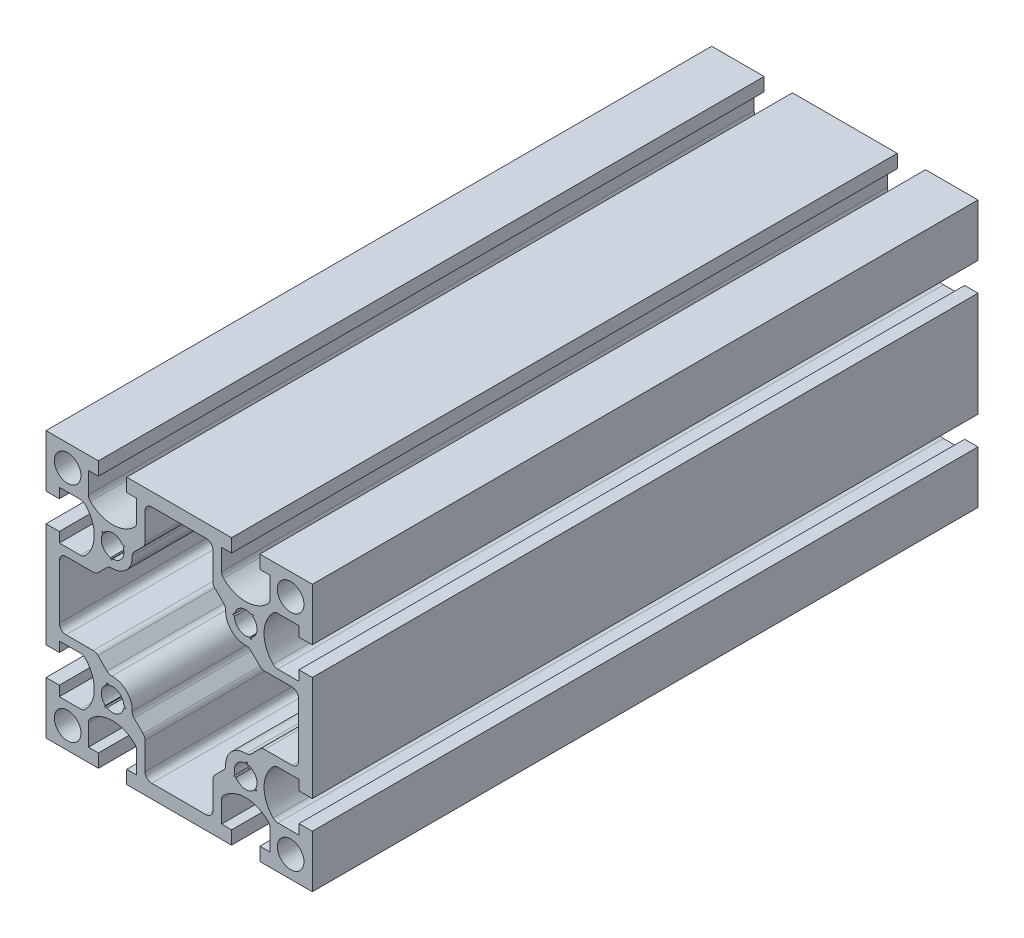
from build123d import *

# Parameters (mm, degrees)
SKETCH_1_W          = 80
SKETCH_1_H          = 80
EXTRUDE_1_DEPTH     = 100
SKETCH_2_R          = 4
SKETCH_2_R_2        = 3.4
CUT_EXTRUDE_1_DEPTH = 208.846096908
CUT_EXTRUDE_2_DEPTH = 208.846096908
CUT_EXTRUDE_3_DEPTH = 208.846096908
CUT_EXTRUDE_4_DEPTH = 208.846096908


with BuildPart() as part:
    # Sketch 1 → Extrude 1 (new, symmetric)
    with BuildSketch(Plane.XY):
        Rectangle(SKETCH_1_W, SKETCH_1_H)
    extrude(amount=EXTRUDE_1_DEPTH, both=True)

    # Sketch 2 → Cut-Extrude 1 (cut, through all)
    with BuildSketch(Plane.XY.offset(100)):
        with Locations((-33.5, -33.5)):
            Circle(SKETCH_2_R)
        with Locations((-20, -20)):
            Circle(SKETCH_2_R_2)
        with Locations(Location((33.5, -33.5, 0), (0, 0, 180))):
            Circle(SKETCH_2_R)
        with Locations(Location((20, -20, 0), (0, 0, 180))):
            Circle(SKETCH_2_R_2)
        with Locations((33.5, 33.5)):
            Circle(SKETCH_2_R)
        with Locations((20, 20)):
            Circle(SKETCH_2_R_2)
        with Locations(Location((-20, 20, 0), (0, 0, 180))):
            Circle(SKETCH_2_R_2)
        with Locations(Location((-33.5, 33.5, 0), (0, 0, 180))):
            Circle(SKETCH_2_R)
    extrude(amount=-CUT_EXTRUDE_1_DEPTH, mode=Mode.SUBTRACT)

    # Sketch 3 → Cut-Extrude 2 (cut, through all)
    with BuildSketch(Plane.XY.offset(100)):
        with BuildLine():
            Line((-40, -15.75), (-40, -24.25))
            Line((-40, -24.25), (-36, -24.25))
            Line((-36, -24.25), (-36, -27.25))
            Line((-36, -27.25), (-29.643928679, -27.25))
            ThreePointArc((-29.643928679, -27.25), (-28.869332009, -27.093908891), (-28.215642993, -26.65))
            ThreePointArc((-28.215642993, -26.65), (-25.5, -20), (-28.215642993, -13.35))
            ThreePointArc((-28.215642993, -13.35), (-28.869332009, -12.906091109), (-29.643928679, -12.75))
            Line((-29.643928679, -12.75), (-36, -12.75))
            Line((-36, -12.75), (-36, -15.75))
            Line((-36, -15.75), (-40, -15.75))
        make_face()
        with BuildLine():
            Line((-12.75, -36), (-12.75, -29.643928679))
            ThreePointArc((-12.75, -29.643928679), (-12.906091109, -28.869332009), (-13.35, -28.215642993))
            ThreePointArc((-13.35, -28.215642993), (-20, -25.5), (-26.65, -28.215642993))
            ThreePointArc((-26.65, -28.215642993), (-27.093908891, -28.869332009), (-27.25, -29.643928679))
            Line((-27.25, -29.643928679), (-27.25, -36))
            Line((-27.25, -36), (-24.25, -36))
            Line((-24.25, -36), (-24.25, -40))
            Line((-24.25, -40), (-15.75, -40))
            Line((-15.75, -40), (-15.75, -36))
            Line((-15.75, -36), (-12.75, -36))
        make_face()
        with BuildLine():
            Line((-15.75, 40), (-24.25, 40))
            Line((-24.25, 40), (-24.25, 36))
            Line((-24.25, 36), (-27.25, 36))
            Line((-27.25, 36), (-27.25, 29.643928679))
            ThreePointArc((-27.25, 29.643928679), (-27.093908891, 28.869332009), (-26.65, 28.215642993))
            ThreePointArc((-26.65, 28.215642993), (-20, 25.5), (-13.35, 28.215642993))
            ThreePointArc((-13.35, 28.215642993), (-12.906091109, 28.869332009), (-12.75, 29.643928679))
            Line((-12.75, 29.643928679), (-12.75, 36))
            Line((-12.75, 36), (-15.75, 36))
            Line((-15.75, 36), (-15.75, 40))
        make_face()
        with BuildLine():
            Line((-36, 12.75), (-29.643928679, 12.75))
            ThreePointArc((-29.643928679, 12.75), (-28.869332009, 12.906091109), (-28.215642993, 13.35))
            ThreePointArc((-28.215642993, 13.35), (-25.5, 20), (-28.215642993, 26.65))
            ThreePointArc((-28.215642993, 26.65), (-28.869332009, 27.093908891), (-29.643928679, 27.25))
            Line((-29.643928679, 27.25), (-36, 27.25))
            Line((-36, 27.25), (-36, 24.25))
            Line((-36, 24.25), (-40, 24.25))
            Line((-40, 24.25), (-40, 15.75))
            Line((-40, 15.75), (-36, 15.75))
            Line((-36, 15.75), (-36, 12.75))
        make_face()
        with BuildLine():
            Line((40, 15.75), (40, 24.25))
            Line((40, 24.25), (36, 24.25))
            Line((36, 24.25), (36, 27.25))
            Line((36, 27.25), (29.643928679, 27.25))
            ThreePointArc((29.643928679, 27.25), (28.869332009, 27.093908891), (28.215642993, 26.65))
            ThreePointArc((28.215642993, 26.65), (25.5, 20), (28.215642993, 13.35))
            ThreePointArc((28.215642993, 13.35), (28.869332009, 12.906091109), (29.643928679, 12.75))
            Line((29.643928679, 12.75), (36, 12.75))
            Line((36, 12.75), (36, 15.75))
            Line((36, 15.75), (40, 15.75))
        make_face()
        with BuildLine():
            Line((12.75, 36), (12.75, 29.643928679))
            ThreePointArc((12.75, 29.643928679), (12.906091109, 28.869332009), (13.35, 28.215642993))
            ThreePointArc((13.35, 28.215642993), (20, 25.5), (26.65, 28.215642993))
            ThreePointArc((26.65, 28.215642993), (27.093908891, 28.869332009), (27.25, 29.643928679))
            Line((27.25, 29.643928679), (27.25, 36))
            Line((27.25, 36), (24.25, 36))
            Line((24.25, 36), (24.25, 40))
            Line((24.25, 40), (15.75, 40))
            Line((15.75, 40), (15.75, 36))
            Line((15.75, 36), (12.75, 36))
        make_face()
        with BuildLine():
            Line((15.75, -40), (24.25, -40))
            Line((24.25, -40), (24.25, -36))
            Line((24.25, -36), (27.25, -36))
            Line((27.25, -36), (27.25, -29.643928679))
            ThreePointArc((27.25, -29.643928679), (27.093908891, -28.869332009), (26.65, -28.215642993))
            ThreePointArc((26.65, -28.215642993), (20, -25.5), (13.35, -28.215642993))
            ThreePointArc((13.35, -28.215642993), (12.906091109, -28.869332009), (12.75, -29.643928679))
            Line((12.75, -29.643928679), (12.75, -36))
            Line((12.75, -36), (15.75, -36))
            Line((15.75, -36), (15.75, -40))
        make_face()
        with BuildLine():
            Line((36, -12.75), (29.643928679, -12.75))
            ThreePointArc((29.643928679, -12.75), (28.869332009, -12.906091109), (28.215642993, -13.35))
            ThreePointArc((28.215642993, -13.35), (25.5, -20), (28.215642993, -26.65))
            ThreePointArc((28.215642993, -26.65), (28.869332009, -27.093908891), (29.643928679, -27.25))
            Line((29.643928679, -27.25), (36, -27.25))
            Line((36, -27.25), (36, -24.25))
            Line((36, -24.25), (40, -24.25))
            Line((40, -24.25), (40, -15.75))
            Line((40, -15.75), (36, -15.75))
            Line((36, -15.75), (36, -12.75))
        make_face()
    extrude(amount=-CUT_EXTRUDE_2_DEPTH, mode=Mode.SUBTRACT)

    # Sketch 4 → Cut-Extrude 3 (cut, through all)
    with BuildSketch(Plane.XY.offset(100)):
        with BuildLine():
            Line((-36, 0), (-36, 8.25))
            ThreePointArc((-36, 8.25), (-35.414213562, 9.664213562), (-34, 10.25))
            Line((-34, 10.25), (-25.799918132, 10.25))
            ThreePointArc((-25.799918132, 10.25), (-25.034551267, 10.402240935), (-24.385704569, 10.835786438))
            Line((-24.385704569, 10.835786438), (-21.702032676, 13.519458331))
            ThreePointArc((-21.702032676, 13.519458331), (-21.019393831, 13.966641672), (-20.214953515, 14.103916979))
            ThreePointArc((-20.214953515, 14.103916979), (-15.828069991, 15.828069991), (-14.103916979, 20.214953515))
            ThreePointArc((-14.103916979, 20.214953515), (-13.966641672, 21.019393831), (-13.519458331, 21.702032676))
            Line((-13.519458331, 21.702032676), (-10.835786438, 24.385704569))
            ThreePointArc((-10.835786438, 24.385704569), (-10.402240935, 25.034551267), (-10.25, 25.799918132))
            Line((-10.25, 25.799918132), (-10.25, 34))
            ThreePointArc((-10.25, 34), (-9.664213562, 35.414213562), (-8.25, 36))
            Line((-8.25, 36), (-0.123376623, 36))
            Line((-0.123376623, 36), (8.126623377, 36))
            ThreePointArc((8.126623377, 36), (9.540836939, 35.414213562), (10.126623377, 34))
            Line((10.126623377, 34), (10.126623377, 25.799918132))
            ThreePointArc((10.126623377, 25.799918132), (10.278864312, 25.034551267), (10.712409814, 24.385704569))
            Line((10.712409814, 24.385704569), (13.396081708, 21.702032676))
            ThreePointArc((13.396081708, 21.702032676), (13.843265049, 21.019393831), (13.980540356, 20.214953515))
            ThreePointArc((13.980540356, 20.214953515), (15.704693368, 15.828069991), (20.091576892, 14.103916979))
            ThreePointArc((20.091576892, 14.103916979), (20.896017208, 13.966641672), (21.578656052, 13.519458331))
            Line((21.578656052, 13.519458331), (24.262327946, 10.835786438))
            ThreePointArc((24.262327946, 10.835786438), (24.911174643, 10.402240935), (25.676541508, 10.25))
            Line((25.676541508, 10.25), (33.876623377, 10.25))
            ThreePointArc((33.876623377, 10.25), (35.290836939, 9.664213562), (35.876623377, 8.25))
            Line((35.876623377, 8.25), (35.876623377, 0.123376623))
            Line((35.876623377, 0.123376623), (35.876623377, -8.126623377))
            ThreePointArc((35.876623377, -8.126623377), (35.290836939, -9.540836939), (33.876623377, -10.126623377))
            Line((33.876623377, -10.126623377), (25.676541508, -10.126623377))
            ThreePointArc((25.676541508, -10.126623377), (24.911174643, -10.278864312), (24.262327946, -10.712409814))
            Line((24.262327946, -10.712409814), (21.578656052, -13.396081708))
            ThreePointArc((21.578656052, -13.396081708), (20.896017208, -13.843265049), (20.091576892, -13.980540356))
            ThreePointArc((20.091576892, -13.980540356), (15.704693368, -15.704693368), (13.980540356, -20.091576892))
            ThreePointArc((13.980540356, -20.091576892), (13.843265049, -20.896017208), (13.396081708, -21.578656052))
            Line((13.396081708, -21.578656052), (10.712409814, -24.262327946))
            ThreePointArc((10.712409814, -24.262327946), (10.278864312, -24.911174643), (10.126623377, -25.676541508))
            Line((10.126623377, -25.676541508), (10.126623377, -33.876623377))
            ThreePointArc((10.126623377, -33.876623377), (9.540836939, -35.290836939), (8.126623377, -35.876623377))
            Line((8.126623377, -35.876623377), (0, -35.876623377))
            Line((0, -35.876623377), (-8.25, -35.876623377))
            ThreePointArc((-8.25, -35.876623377), (-9.664213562, -35.290836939), (-10.25, -33.876623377))
            Line((-10.25, -33.876623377), (-10.25, -25.676541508))
            ThreePointArc((-10.25, -25.676541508), (-10.402240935, -24.911174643), (-10.835786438, -24.262327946))
            Line((-10.835786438, -24.262327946), (-13.519458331, -21.578656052))
            ThreePointArc((-13.519458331, -21.578656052), (-13.966641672, -20.896017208), (-14.103916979, -20.091576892))
            ThreePointArc((-14.103916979, -20.091576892), (-15.828069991, -15.704693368), (-20.214953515, -13.980540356))
            ThreePointArc((-20.214953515, -13.980540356), (-21.019393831, -13.843265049), (-21.702032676, -13.396081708))
            Line((-21.702032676, -13.396081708), (-24.385704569, -10.712409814))
            ThreePointArc((-24.385704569, -10.712409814), (-25.034551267, -10.278864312), (-25.799918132, -10.126623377))
            Line((-25.799918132, -10.126623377), (-34, -10.126623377))
            ThreePointArc((-34, -10.126623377), (-35.414213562, -9.540836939), (-36, -8.126623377))
            Line((-36, -8.126623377), (-36, 0))
        make_face()
    extrude(amount=-CUT_EXTRUDE_3_DEPTH, mode=Mode.SUBTRACT)

    # Sketch 5 → Cut-Extrude 4 (cut, through all)
    with BuildSketch(Plane.XY.offset(100)):
        with BuildLine():
            Line((-16.6, -20), (-16.253671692, -20.135073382))
            ThreePointArc((-16.253671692, -20.135073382), (-16.127104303, -20.338834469), (-16.287131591, -20.51752177))
            Line((-16.287131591, -20.51752177), (-16.65165364, -20.590403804))
            ThreePointArc((-16.65165364, -20.590403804), (-16.612938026, -20.296329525), (-16.6, -20))
        make_face()
        with BuildLine():
            Line((-21.7, -22.944486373), (-21.990141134, -23.176878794))
            ThreePointArc((-21.990141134, -23.176878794), (-22.229887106, -23.184608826), (-22.304621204, -22.956677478))
            Line((-22.304621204, -22.956677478), (-22.185477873, -22.604551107))
            ThreePointArc((-22.185477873, -22.604551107), (-21.950159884, -22.785116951), (-21.7, -22.944486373))
        make_face()
        with BuildLine():
            Line((-21.7, -17.055513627), (-21.756187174, -16.688047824))
            ThreePointArc((-21.756187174, -16.688047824), (-21.643008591, -16.476556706), (-21.408247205, -16.525800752))
            Line((-21.408247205, -16.525800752), (-21.162868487, -16.805045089))
            ThreePointArc((-21.162868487, -16.805045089), (-21.43690209, -16.918553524), (-21.7, -17.055513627))
        make_face()
        with BuildLine():
            Line((-17.055513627, 21.7), (-16.688047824, 21.756187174))
            ThreePointArc((-16.688047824, 21.756187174), (-16.476556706, 21.643008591), (-16.525800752, 21.408247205))
            Line((-16.525800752, 21.408247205), (-16.805045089, 21.162868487))
            ThreePointArc((-16.805045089, 21.162868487), (-16.918553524, 21.43690209), (-17.055513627, 21.7))
        make_face()
        with BuildLine():
            Line((-20, 16.6), (-20.135073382, 16.253671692))
            ThreePointArc((-20.135073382, 16.253671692), (-20.338834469, 16.127104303), (-20.51752177, 16.287131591))
            Line((-20.51752177, 16.287131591), (-20.590403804, 16.65165364))
            ThreePointArc((-20.590403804, 16.65165364), (-20.296329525, 16.612938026), (-20, 16.6))
        make_face()
        with BuildLine():
            Line((-22.944486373, 21.7), (-23.176878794, 21.990141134))
            ThreePointArc((-23.176878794, 21.990141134), (-23.184608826, 22.229887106), (-22.956677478, 22.304621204))
            Line((-22.956677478, 22.304621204), (-22.604551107, 22.185477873))
            ThreePointArc((-22.604551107, 22.185477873), (-22.785116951, 21.950159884), (-22.944486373, 21.7))
        make_face()
        with BuildLine():
            Line((21.7, 17.055513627), (21.756187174, 16.688047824))
            ThreePointArc((21.756187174, 16.688047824), (21.643008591, 16.476556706), (21.408247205, 16.525800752))
            Line((21.408247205, 16.525800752), (21.162868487, 16.805045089))
            ThreePointArc((21.162868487, 16.805045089), (21.43690209, 16.918553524), (21.7, 17.055513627))
        make_face()
        with BuildLine():
            Line((16.6, 20), (16.253671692, 20.135073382))
            ThreePointArc((16.253671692, 20.135073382), (16.127104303, 20.338834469), (16.287131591, 20.51752177))
            Line((16.287131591, 20.51752177), (16.65165364, 20.590403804))
            ThreePointArc((16.65165364, 20.590403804), (16.612938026, 20.296329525), (16.6, 20))
        make_face()
        with BuildLine():
            Line((21.7, 22.944486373), (21.990141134, 23.176878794))
            ThreePointArc((21.990141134, 23.176878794), (22.229887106, 23.184608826), (22.304621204, 22.956677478))
            Line((22.304621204, 22.956677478), (22.185477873, 22.604551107))
            ThreePointArc((22.185477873, 22.604551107), (21.950159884, 22.785116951), (21.7, 22.944486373))
        make_face()
        with BuildLine():
            Line((17.055513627, -21.7), (16.688047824, -21.756187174))
            ThreePointArc((16.688047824, -21.756187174), (16.476556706, -21.643008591), (16.525800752, -21.408247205))
            Line((16.525800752, -21.408247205), (16.805045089, -21.162868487))
            ThreePointArc((16.805045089, -21.162868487), (16.918553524, -21.43690209), (17.055513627, -21.7))
        make_face()
        with BuildLine():
            Line((20, -16.6), (20.135073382, -16.253671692))
            ThreePointArc((20.135073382, -16.253671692), (20.338834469, -16.127104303), (20.51752177, -16.287131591))
            Line((20.51752177, -16.287131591), (20.590403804, -16.65165364))
            ThreePointArc((20.590403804, -16.65165364), (20.296329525, -16.612938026), (20, -16.6))
        make_face()
        with BuildLine():
            Line((22.944486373, -21.7), (23.176878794, -21.990141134))
            ThreePointArc((23.176878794, -21.990141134), (23.184608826, -22.229887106), (22.956677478, -22.304621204))
            Line((22.956677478, -22.304621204), (22.604551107, -22.185477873))
            ThreePointArc((22.604551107, -22.185477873), (22.785116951, -21.950159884), (22.944486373, -21.7))
        make_face()
    extrude(amount=-CUT_EXTRUDE_4_DEPTH, mode=Mode.SUBTRACT)


solid = part.part
